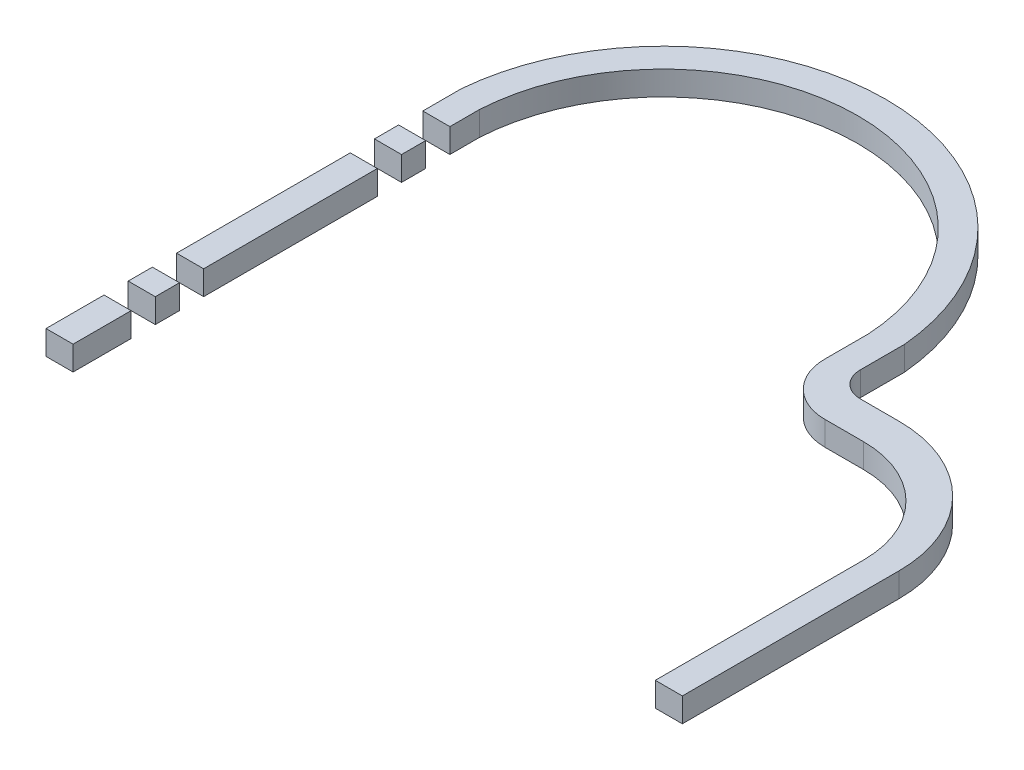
from build123d import *

# Parameters (mm, degrees)
RIM_DEPTH         = 3.175
HINGE_SLOTS_REACH = 95.854
SKETCH3_W         = 3.175
SKETCH3_H         = 3.175


with BuildPart() as part:
    # Sketch2 → rim (new body)
    with BuildSketch(Plane(origin=(0, 0, 0), x_dir=(1, 0, 0), z_dir=(0, 1, 0))):
        with BuildLine():
            Line((3.302, -38.608), (6.858, -38.608))
            Line((6.858, -38.608), (6.858, -10.16))
            ThreePointArc((6.858, -10.16), (1.873543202, 1.873543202), (-10.16, 6.858))
            Line((-10.16, 6.858), (-15.24, 6.858))
            ThreePointArc((-15.24, 6.858), (-17.574866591, 7.825133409), (-18.542, 10.16))
            Line((-18.542, 10.16), (-18.542, 15.953751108))
            ThreePointArc((-18.542, 15.953751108), (-47.625, 42.606368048), (-76.708, 15.953751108))
            Line((-76.708, 15.953751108), (-76.708, -38.608))
            Line((-76.708, -38.608), (-73.152, -38.608))
            Line((-73.152, -38.608), (-73.152, 14.778504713))
            ThreePointArc((-73.152, 14.778504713), (-47.625, 38.902781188), (-22.098, 14.778504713))
            Line((-22.098, 14.778504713), (-22.098, 9.063504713))
            ThreePointArc((-22.098, 9.063504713), (-20.089338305, 4.214166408), (-15.24, 2.205504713))
            Line((-15.24, 2.205504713), (-10.16, 2.205504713))
            ThreePointArc((-10.16, 2.205504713), (-0.640928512, -1.737423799), (3.302, -11.256495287))
            Line((3.302, -11.256495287), (3.302, -38.608))
        make_face()
    extrude(amount=RIM_DEPTH)

    # Sketch3 → hinge slots (cut, up to next)
    with BuildSketch(Plane.ZY.offset(76.708), mode=Mode.PRIVATE) as hinge_slots_sk1:
        with Locations((-9.286251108, 1.5875)):
            Rectangle(SKETCH3_W, SKETCH3_H)
    hinge_slots_tool1 = extrude(hinge_slots_sk1.sketch, amount=-HINGE_SLOTS_REACH, mode=Mode.PRIVATE) & part.part
    # Sketch3 → hinge slots (cut, up to next)
    with BuildSketch(Plane.ZY.offset(76.708), mode=Mode.PRIVATE) as hinge_slots_sk2:
        with Locations((-2.936251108, 1.5875)):
            Rectangle(SKETCH3_W, SKETCH3_H)
    hinge_slots_tool2 = extrude(hinge_slots_sk2.sketch, amount=-HINGE_SLOTS_REACH, mode=Mode.PRIVATE) & part.part
    # Sketch3 → hinge slots (cut, up to next)
    with BuildSketch(Plane.ZY.offset(76.708), mode=Mode.PRIVATE) as hinge_slots_sk3:
        with Locations((23.0505, 1.5875)):
            Rectangle(SKETCH3_W, SKETCH3_H)
    hinge_slots_tool3 = extrude(hinge_slots_sk3.sketch, amount=-HINGE_SLOTS_REACH, mode=Mode.PRIVATE) & part.part
    # Sketch3 → hinge slots (cut, up to next)
    with BuildSketch(Plane.ZY.offset(76.708), mode=Mode.PRIVATE) as hinge_slots_sk4:
        with Locations((29.4005, 1.5875)):
            Rectangle(SKETCH3_W, SKETCH3_H)
    hinge_slots_tool4 = extrude(hinge_slots_sk4.sketch, amount=-HINGE_SLOTS_REACH, mode=Mode.PRIVATE) & part.part
    add(hinge_slots_tool1.solids().sort_by_distance((-76.708, 1.5875, -9.286251))[0], mode=Mode.SUBTRACT)
    add(hinge_slots_tool2.solids().sort_by_distance((-76.708, 1.5875, -2.936251))[0], mode=Mode.SUBTRACT)
    add(hinge_slots_tool3.solids().sort_by_distance((-76.708, 1.5875, 23.0505))[0], mode=Mode.SUBTRACT)
    add(hinge_slots_tool4.solids().sort_by_distance((-76.708, 1.5875, 29.4005))[0], mode=Mode.SUBTRACT)


with BuildPart() as hinge_slots_piece_1:
    # of the separate pieces the step leaves, piece 1, a body of its own (hinge_slots_pieces)
    add(part.part.solids().sort_by_distance((-73.152, 0, -14.778504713))[0])


with BuildPart() as hinge_slots_piece_2:
    # of the separate pieces the step leaves, piece 2, a body of its own (hinge_slots_pieces)
    add(part.part.solids().sort_by_distance((-73.152, 0, 21.463))[0])


with BuildPart() as hinge_slots_piece_3:
    # of the separate pieces the step leaves, piece 3, a body of its own (hinge_slots_pieces)
    add(part.part.solids().sort_by_distance((-73.152, 0, 38.608))[0])


with BuildPart() as hinge_slots_piece_4:
    # of the separate pieces the step leaves, piece 4, a body of its own (hinge_slots_pieces)
    add(part.part.solids().sort_by_distance((-73.152, 0, 27.813))[0])


with BuildPart() as hinge_slots_piece_5:
    # of the separate pieces the step leaves, piece 5, a body of its own (hinge_slots_pieces)
    add(part.part.solids().sort_by_distance((-73.152, 0, -4.523751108))[0])


solid = Compound([hinge_slots_piece_1.part, hinge_slots_piece_2.part, hinge_slots_piece_3.part, hinge_slots_piece_4.part, hinge_slots_piece_5.part])
